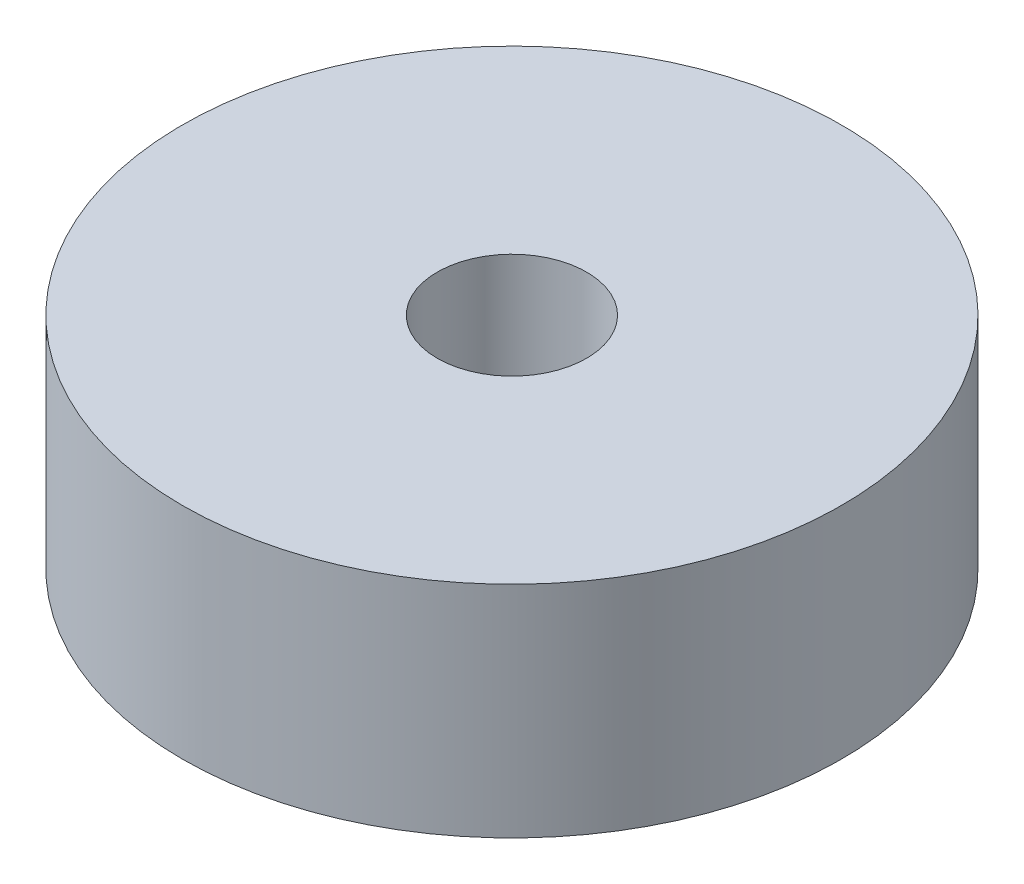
from build123d import *

# Parameters (mm, degrees)
ESQUISSE1_R      = 15
ESQUISSE1_R_2    = 3.4
EXTRUSION1_DEPTH = 10


with BuildPart() as part:
    # Esquisse1 → Extrusion1 (new body)
    with BuildSketch(Plane(origin=(0, 0, 0), x_dir=(1, 0, 0), z_dir=(0, 1, 0))):
        with Locations(Location((0, 0, 0), (0, 0, 270))):
            Circle(ESQUISSE1_R)
        with Locations(Location((0, 0, 0), (0, 0, 270))):
            Circle(ESQUISSE1_R_2, mode=Mode.SUBTRACT)
    extrude(amount=EXTRUSION1_DEPTH)


solid = part.part
